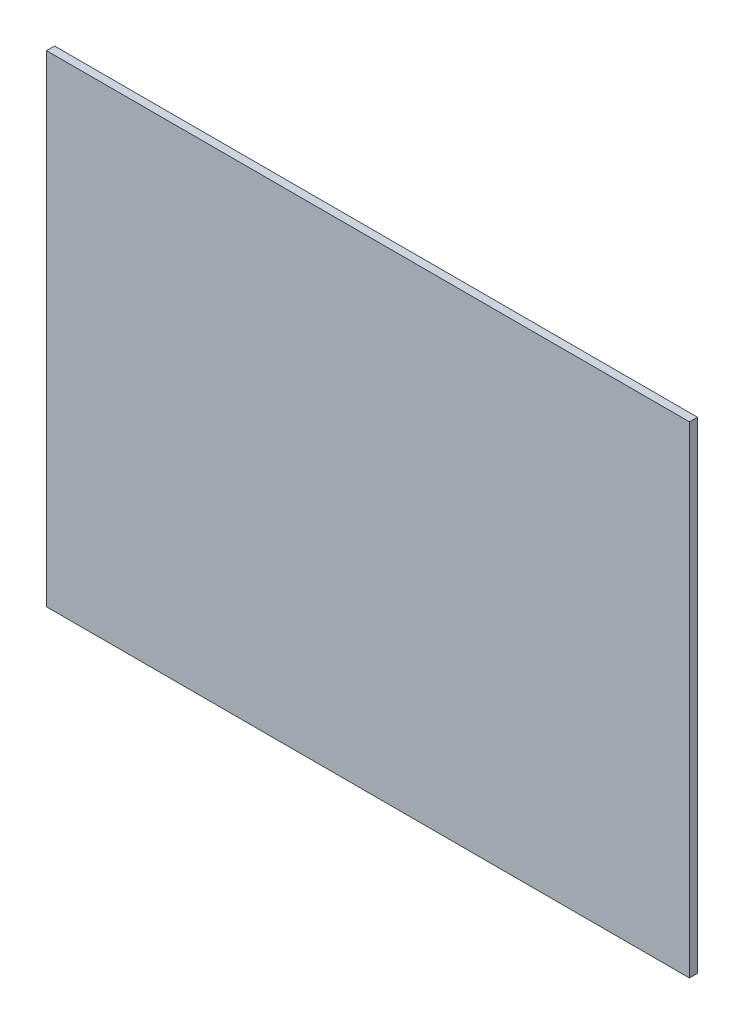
ISO-10303-21;
HEADER;
FILE_DESCRIPTION(('STEP AP214'),'2;1');
FILE_NAME('part.step','',(''),(''),'','','');
FILE_SCHEMA(('AUTOMOTIVE_DESIGN { 1 0 10303 214 1 1 1 1 }'));
ENDSEC;
DATA;
#1=APPLICATION_CONTEXT('core data for automotive mechanical design processes');
#2=APPLICATION_PROTOCOL_DEFINITION('international standard','automotive_design',2000,#1);
#3=PRODUCT_CONTEXT('',#1,'mechanical');
#4=PRODUCT('Part','Part','',(#3));
#5=PRODUCT_RELATED_PRODUCT_CATEGORY('part','',(#4));
#6=PRODUCT_DEFINITION_FORMATION('','',#4);
#7=PRODUCT_DEFINITION_CONTEXT('part definition',#1,'design');
#8=PRODUCT_DEFINITION('design','',#6,#7);
#9=PRODUCT_DEFINITION_SHAPE('','',#8);
#10=(LENGTH_UNIT() NAMED_UNIT(*) SI_UNIT(.MILLI.,.METRE.));
#11=(NAMED_UNIT(*) PLANE_ANGLE_UNIT() SI_UNIT($,.RADIAN.));
#12=(NAMED_UNIT(*) SI_UNIT($,.STERADIAN.) SOLID_ANGLE_UNIT());
#13=UNCERTAINTY_MEASURE_WITH_UNIT(LENGTH_MEASURE(1.E-05),#10,'distance_accuracy_value','');
#14=(GEOMETRIC_REPRESENTATION_CONTEXT(3) GLOBAL_UNCERTAINTY_ASSIGNED_CONTEXT((#13)) GLOBAL_UNIT_ASSIGNED_CONTEXT((#10,
#11,#12)) REPRESENTATION_CONTEXT('',''));
#15=CARTESIAN_POINT('',(0.,0.,0.));
#16=DIRECTION('',(0.,0.,1.));
#17=DIRECTION('',(1.,0.,0.));
#18=AXIS2_PLACEMENT_3D('',#15,#16,#17);
#19=CARTESIAN_POINT('',(0.40005254,0.29971746,0.));
#20=DIRECTION('',(0.999999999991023,-4.2373240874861E-06,0.));
#21=DIRECTION('',(0.,0.,-1.));
#22=AXIS2_PLACEMENT_3D('',#19,#20,#21);
#23=PLANE('',#22);
#24=DIRECTION('',(0.,0.,1.));
#25=VECTOR('',#24,1.);
#26=CARTESIAN_POINT('',(0.40005254,0.29971746,0.));
#27=LINE('',#26,#25);
#28=CARTESIAN_POINT('',(0.40005254,0.29971746,0.));
#29=VERTEX_POINT('',#28);
#30=CARTESIAN_POINT('',(0.40005254,0.29971746,0.00999998));
#31=VERTEX_POINT('',#30);
#32=EDGE_CURVE('E11',#29,#31,#27,.T.);
#33=ORIENTED_EDGE('',*,*,#32,.T.);
#34=DIRECTION('',(-4.2373240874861E-06,-0.999999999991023,0.));
#35=VECTOR('',#34,1.);
#36=CARTESIAN_POINT('',(0.40005254,0.29971746,0.00999998));
#37=LINE('',#36,#35);
#38=CARTESIAN_POINT('',(0.40005,-0.29971746,0.00999998));
#39=VERTEX_POINT('',#38);
#40=EDGE_CURVE('E65',#31,#39,#37,.T.);
#41=ORIENTED_EDGE('',*,*,#40,.T.);
#42=DIRECTION('',(0.,0.,1.));
#43=VECTOR('',#42,1.);
#44=CARTESIAN_POINT('',(0.40005,-0.29971746,0.));
#45=LINE('',#44,#43);
#46=CARTESIAN_POINT('',(0.40005,-0.29971746,0.));
#47=VERTEX_POINT('',#46);
#48=EDGE_CURVE('E59',#47,#39,#45,.T.);
#49=ORIENTED_EDGE('',*,*,#48,.F.);
#50=DIRECTION('',(-4.2373240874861E-06,-0.999999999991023,0.));
#51=VECTOR('',#50,1.);
#52=CARTESIAN_POINT('',(0.40005254,0.29971746,0.));
#53=LINE('',#52,#51);
#54=EDGE_CURVE('E62',#29,#47,#53,.T.);
#55=ORIENTED_EDGE('',*,*,#54,.F.);
#56=EDGE_LOOP('',(#33,#41,#49,#55));
#57=FACE_BOUND('',#56,.T.);
#58=ADVANCED_FACE('F17',(#57),#23,.T.);
#59=CARTESIAN_POINT('',(-0.40005,0.29971746,0.));
#60=DIRECTION('',(0.,1.,0.));
#61=DIRECTION('',(1.,0.,0.));
#62=AXIS2_PLACEMENT_3D('',#59,#60,#61);
#63=PLANE('',#62);
#64=DIRECTION('',(0.,0.,1.));
#65=VECTOR('',#64,1.);
#66=CARTESIAN_POINT('',(-0.40005,0.29971746,0.));
#67=LINE('',#66,#65);
#68=CARTESIAN_POINT('',(-0.40005,0.29971746,0.));
#69=VERTEX_POINT('',#68);
#70=CARTESIAN_POINT('',(-0.40005,0.29971746,0.00999998));
#71=VERTEX_POINT('',#70);
#72=EDGE_CURVE('E101',#69,#71,#67,.T.);
#73=ORIENTED_EDGE('',*,*,#72,.T.);
#74=DIRECTION('',(1.,0.,0.));
#75=VECTOR('',#74,1.);
#76=CARTESIAN_POINT('',(-0.40005,0.29971746,0.00999998));
#77=LINE('',#76,#75);
#78=EDGE_CURVE('E26',#71,#31,#77,.T.);
#79=ORIENTED_EDGE('',*,*,#78,.T.);
#80=ORIENTED_EDGE('',*,*,#32,.F.);
#81=DIRECTION('',(1.,0.,0.));
#82=VECTOR('',#81,1.);
#83=CARTESIAN_POINT('',(-0.40005,0.29971746,0.));
#84=LINE('',#83,#82);
#85=EDGE_CURVE('E85',#69,#29,#84,.T.);
#86=ORIENTED_EDGE('',*,*,#85,.F.);
#87=EDGE_LOOP('',(#73,#79,#80,#86));
#88=FACE_BOUND('',#87,.T.);
#89=ADVANCED_FACE('F203',(#88),#63,.T.);
#90=CARTESIAN_POINT('',(6.350013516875E-07,2.719766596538E-07,0.00999998));
#91=DIRECTION('',(0.,0.,-1.));
#92=DIRECTION('',(0.,-1.,0.));
#93=AXIS2_PLACEMENT_3D('',#90,#91,#92);
#94=PLANE('',#93);
#95=DIRECTION('',(-1.,0.,0.));
#96=VECTOR('',#95,1.);
#97=CARTESIAN_POINT('',(0.40005,-0.29971746,0.00999998));
#98=LINE('',#97,#96);
#99=CARTESIAN_POINT('',(-0.40005,-0.29971746,0.00999998));
#100=VERTEX_POINT('',#99);
#101=EDGE_CURVE('E70',#39,#100,#98,.T.);
#102=ORIENTED_EDGE('',*,*,#101,.F.);
#103=ORIENTED_EDGE('',*,*,#40,.F.);
#104=ORIENTED_EDGE('',*,*,#78,.F.);
#105=DIRECTION('',(0.,1.,0.));
#106=VECTOR('',#105,1.);
#107=CARTESIAN_POINT('',(-0.40005,-0.29971746,0.00999998));
#108=LINE('',#107,#106);
#109=EDGE_CURVE('E97',#100,#71,#108,.T.);
#110=ORIENTED_EDGE('',*,*,#109,.F.);
#111=EDGE_LOOP('',(#102,#103,#104,#110));
#112=FACE_BOUND('',#111,.T.);
#113=ADVANCED_FACE('F195',(#112),#94,.F.);
#114=CARTESIAN_POINT('',(0.40005,-0.29971746,0.));
#115=DIRECTION('',(0.,-1.,0.));
#116=DIRECTION('',(0.,0.,-1.));
#117=AXIS2_PLACEMENT_3D('',#114,#115,#116);
#118=PLANE('',#117);
#119=ORIENTED_EDGE('',*,*,#48,.T.);
#120=ORIENTED_EDGE('',*,*,#101,.T.);
#121=DIRECTION('',(0.,0.,1.));
#122=VECTOR('',#121,1.);
#123=CARTESIAN_POINT('',(-0.40005,-0.29971746,0.));
#124=LINE('',#123,#122);
#125=CARTESIAN_POINT('',(-0.40005,-0.29971746,0.));
#126=VERTEX_POINT('',#125);
#127=EDGE_CURVE('E78',#126,#100,#124,.T.);
#128=ORIENTED_EDGE('',*,*,#127,.F.);
#129=DIRECTION('',(-1.,0.,0.));
#130=VECTOR('',#129,1.);
#131=CARTESIAN_POINT('',(0.40005,-0.29971746,0.));
#132=LINE('',#131,#130);
#133=EDGE_CURVE('E71',#47,#126,#132,.T.);
#134=ORIENTED_EDGE('',*,*,#133,.F.);
#135=EDGE_LOOP('',(#119,#120,#128,#134));
#136=FACE_BOUND('',#135,.T.);
#137=ADVANCED_FACE('F75',(#136),#118,.T.);
#138=CARTESIAN_POINT('',(6.350013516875E-07,2.719766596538E-07,0.));
#139=DIRECTION('',(0.,0.,-1.));
#140=DIRECTION('',(0.,-1.,0.));
#141=AXIS2_PLACEMENT_3D('',#138,#139,#140);
#142=PLANE('',#141);
#143=DIRECTION('',(0.,1.,0.));
#144=VECTOR('',#143,1.);
#145=CARTESIAN_POINT('',(-0.40005,-0.29971746,0.));
#146=LINE('',#145,#144);
#147=EDGE_CURVE('E92',#126,#69,#146,.T.);
#148=ORIENTED_EDGE('',*,*,#147,.T.);
#149=ORIENTED_EDGE('',*,*,#85,.T.);
#150=ORIENTED_EDGE('',*,*,#54,.T.);
#151=ORIENTED_EDGE('',*,*,#133,.T.);
#152=EDGE_LOOP('',(#148,#149,#150,#151));
#153=FACE_BOUND('',#152,.T.);
#154=ADVANCED_FACE('F84',(#153),#142,.T.);
#155=CARTESIAN_POINT('',(-0.40005,-0.29971746,0.));
#156=DIRECTION('',(-1.,0.,0.));
#157=DIRECTION('',(0.,0.,1.));
#158=AXIS2_PLACEMENT_3D('',#155,#156,#157);
#159=PLANE('',#158);
#160=ORIENTED_EDGE('',*,*,#127,.T.);
#161=ORIENTED_EDGE('',*,*,#109,.T.);
#162=ORIENTED_EDGE('',*,*,#72,.F.);
#163=ORIENTED_EDGE('',*,*,#147,.F.);
#164=EDGE_LOOP('',(#160,#161,#162,#163));
#165=FACE_BOUND('',#164,.T.);
#166=ADVANCED_FACE('F176',(#165),#159,.T.);
#167=CLOSED_SHELL('',(#58,#89,#113,#137,#154,#166));
#168=MANIFOLD_SOLID_BREP('B1',#167);
#169=ADVANCED_BREP_SHAPE_REPRESENTATION('',(#18,#168),#14);
#170=SHAPE_DEFINITION_REPRESENTATION(#9,#169);
ENDSEC;
END-ISO-10303-21;
